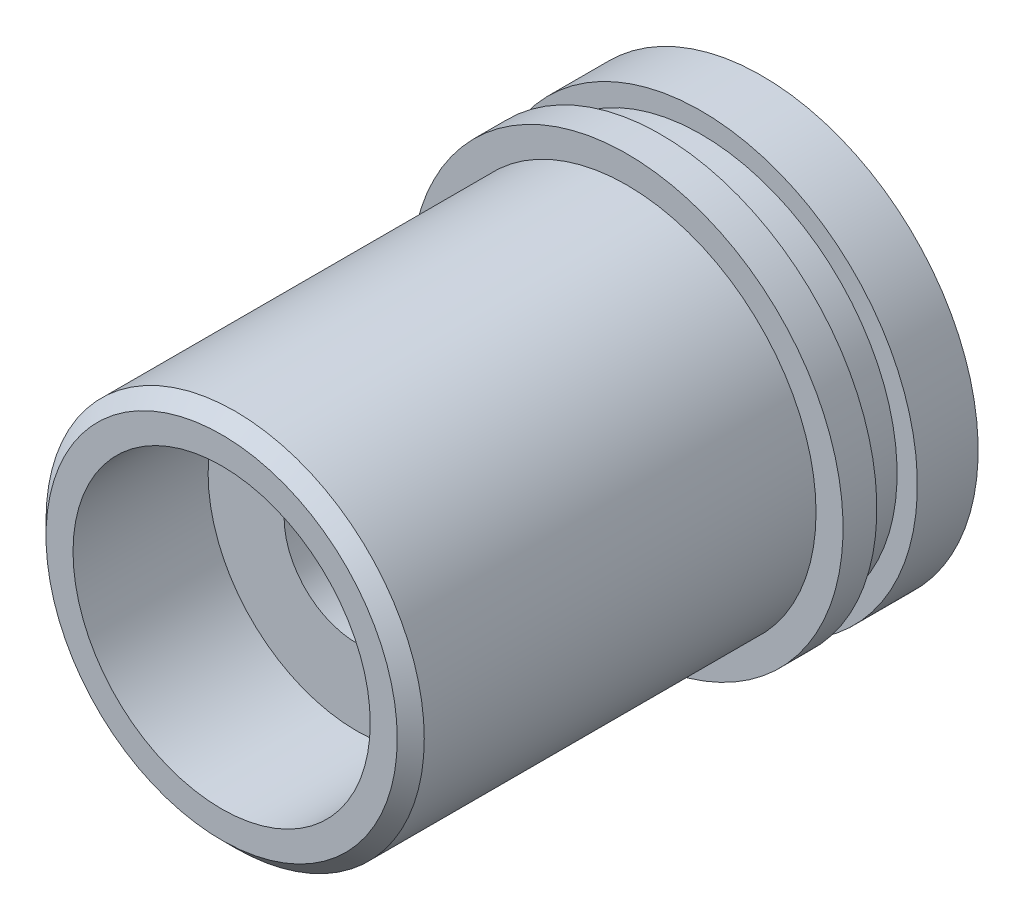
from build123d import *

# Parameters (mm, degrees)
CHANF_1_SIZE = 1


with BuildPart() as part:
    # Esquisse1 → Bague d16 (revolve)
    with BuildSketch(Plane(origin=(0, 0, 0), x_dir=(1, 0, 0), z_dir=(0, 1, 0))):
        Polygon((-8, 10), (-16, 10), (-16, 5.5), (-14.5, 5.5), (-14.5, 2.5), (-16, 2.5), (-16, 0), (-14, 0), (-14, -30), (-11, -30), (-11, -20), (-5.375340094, -20), align=None)
    revolve(axis=Axis((0, 0, -11.087301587), (0, 0, 1)))

    # Chanf 1
    chanf_1_edges = [part.edges().sort_by_distance(p)[0] for p in [
        (14, 0, 30),
    ]]
    chamfer(chanf_1_edges, length=CHANF_1_SIZE)


solid = part.part
